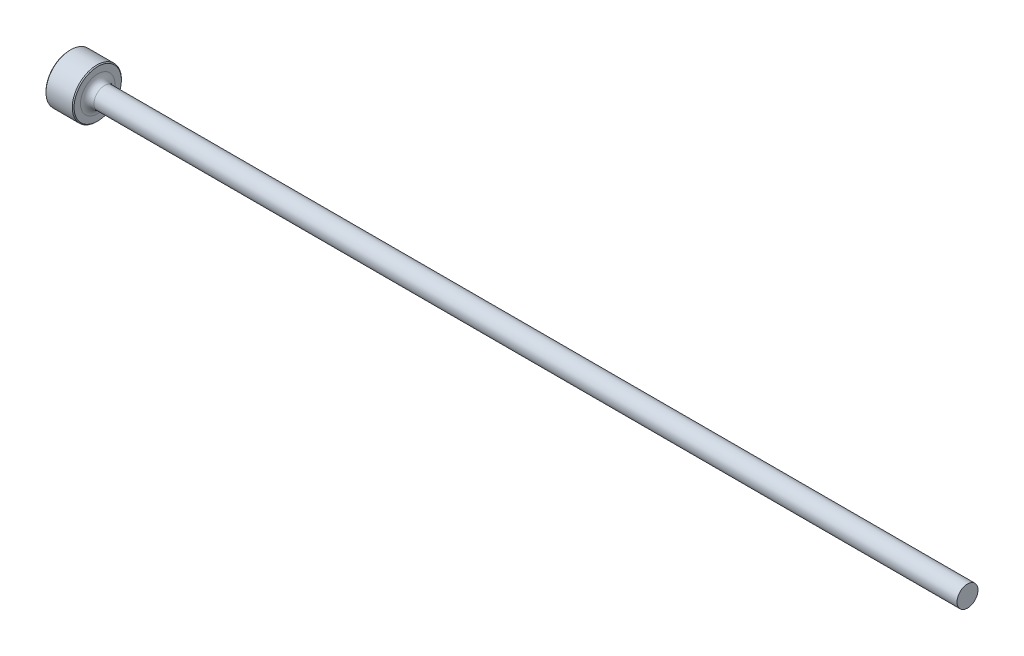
ISO-10303-21;
HEADER;
FILE_DESCRIPTION(('STEP AP214'),'2;1');
FILE_NAME('part.step','',(''),(''),'','','');
FILE_SCHEMA(('AUTOMOTIVE_DESIGN { 1 0 10303 214 1 1 1 1 }'));
ENDSEC;
DATA;
#1=APPLICATION_CONTEXT('core data for automotive mechanical design processes');
#2=APPLICATION_PROTOCOL_DEFINITION('international standard','automotive_design',2000,#1);
#3=PRODUCT_CONTEXT('',#1,'mechanical');
#4=PRODUCT('Part','Part','',(#3));
#5=PRODUCT_RELATED_PRODUCT_CATEGORY('part','',(#4));
#6=PRODUCT_DEFINITION_FORMATION('','',#4);
#7=PRODUCT_DEFINITION_CONTEXT('part definition',#1,'design');
#8=PRODUCT_DEFINITION('design','',#6,#7);
#9=PRODUCT_DEFINITION_SHAPE('','',#8);
#10=(LENGTH_UNIT() NAMED_UNIT(*) SI_UNIT(.MILLI.,.METRE.));
#11=(NAMED_UNIT(*) PLANE_ANGLE_UNIT() SI_UNIT($,.RADIAN.));
#12=(NAMED_UNIT(*) SI_UNIT($,.STERADIAN.) SOLID_ANGLE_UNIT());
#13=UNCERTAINTY_MEASURE_WITH_UNIT(LENGTH_MEASURE(1.E-05),#10,'distance_accuracy_value','');
#14=(GEOMETRIC_REPRESENTATION_CONTEXT(3) GLOBAL_UNCERTAINTY_ASSIGNED_CONTEXT((#13)) GLOBAL_UNIT_ASSIGNED_CONTEXT((#10,
#11,#12)) REPRESENTATION_CONTEXT('',''));
#15=CARTESIAN_POINT('',(0.,0.,0.));
#16=DIRECTION('',(0.,0.,1.));
#17=DIRECTION('',(1.,0.,0.));
#18=AXIS2_PLACEMENT_3D('',#15,#16,#17);
#19=CARTESIAN_POINT('',(101.6,1.18681499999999,0.));
#20=DIRECTION('',(1.,0.,0.));
#21=DIRECTION('',(0.,1.,0.));
#22=AXIS2_PLACEMENT_3D('',#19,#20,#21);
#23=PLANE('',#22);
#24=CARTESIAN_POINT('',(101.6,0.,0.));
#25=DIRECTION('',(1.,0.,0.));
#26=DIRECTION('',(0.,1.,0.));
#27=AXIS2_PLACEMENT_3D('',#24,#25,#26);
#28=CIRCLE('',#27,1.186815);
#29=CARTESIAN_POINT('',(101.6,1.18681499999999,0.));
#30=VERTEX_POINT('',#29);
#31=EDGE_CURVE('E50',#30,#30,#28,.T.);
#32=ORIENTED_EDGE('',*,*,#31,.T.);
#33=EDGE_LOOP('',(#32));
#34=FACE_BOUND('',#33,.T.);
#35=ADVANCED_FACE('F30',(#34),#23,.T.);
#36=CARTESIAN_POINT('',(101.6,0.,0.));
#37=DIRECTION('',(1.,0.,0.));
#38=DIRECTION('',(0.,1.,0.));
#39=AXIS2_PLACEMENT_3D('',#36,#37,#38);
#40=CYLINDRICAL_SURFACE('',#39,1.186815);
#41=CARTESIAN_POINT('',(3.937,0.,0.));
#42=DIRECTION('',(1.,0.,0.));
#43=DIRECTION('',(0.,1.,0.));
#44=AXIS2_PLACEMENT_3D('',#41,#42,#43);
#45=CIRCLE('',#44,1.18681499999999);
#46=CARTESIAN_POINT('',(3.937,1.18681499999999,0.));
#47=VERTEX_POINT('',#46);
#48=EDGE_CURVE('E53',#47,#47,#45,.T.);
#49=ORIENTED_EDGE('',*,*,#48,.T.);
#50=EDGE_LOOP('',(#49));
#51=FACE_BOUND('',#50,.T.);
#52=ORIENTED_EDGE('',*,*,#31,.F.);
#53=EDGE_LOOP('',(#52));
#54=FACE_BOUND('',#53,.T.);
#55=ADVANCED_FACE('F74',(#51,#54),#40,.T.);
#56=CARTESIAN_POINT('',(3.937,0.,0.));
#57=DIRECTION('',(1.,0.,0.));
#58=DIRECTION('',(0.,1.,0.));
#59=AXIS2_PLACEMENT_3D('',#56,#57,#58);
#60=TOROIDAL_SURFACE('',#59,1.94881499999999,0.762);
#61=CARTESIAN_POINT('',(3.175,0.,0.));
#62=DIRECTION('',(1.,0.,0.));
#63=DIRECTION('',(0.,1.,0.));
#64=AXIS2_PLACEMENT_3D('',#61,#62,#63);
#65=CIRCLE('',#64,1.94881499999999);
#66=CARTESIAN_POINT('',(3.175,1.94881499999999,0.));
#67=VERTEX_POINT('',#66);
#68=EDGE_CURVE('E56',#67,#67,#65,.T.);
#69=ORIENTED_EDGE('',*,*,#68,.T.);
#70=EDGE_LOOP('',(#69));
#71=FACE_BOUND('',#70,.T.);
#72=ORIENTED_EDGE('',*,*,#48,.F.);
#73=EDGE_LOOP('',(#72));
#74=FACE_BOUND('',#73,.T.);
#75=ADVANCED_FACE('F60',(#71,#74),#60,.F.);
#76=CARTESIAN_POINT('',(3.175,2.778125,0.));
#77=DIRECTION('',(1.,0.,0.));
#78=DIRECTION('',(0.,1.,0.));
#79=AXIS2_PLACEMENT_3D('',#76,#77,#78);
#80=PLANE('',#79);
#81=CARTESIAN_POINT('',(3.175,0.,0.));
#82=DIRECTION('',(1.,0.,0.));
#83=DIRECTION('',(0.,1.,0.));
#84=AXIS2_PLACEMENT_3D('',#81,#82,#83);
#85=CIRCLE('',#84,2.676525);
#86=CARTESIAN_POINT('',(3.175,2.676525,0.));
#87=VERTEX_POINT('',#86);
#88=EDGE_CURVE('E10',#87,#87,#85,.T.);
#89=ORIENTED_EDGE('',*,*,#88,.T.);
#90=EDGE_LOOP('',(#89));
#91=FACE_BOUND('',#90,.T.);
#92=ORIENTED_EDGE('',*,*,#68,.F.);
#93=EDGE_LOOP('',(#92));
#94=FACE_BOUND('',#93,.T.);
#95=ADVANCED_FACE('F63',(#91,#94),#80,.T.);
#96=CARTESIAN_POINT('',(101.6,0.,0.));
#97=DIRECTION('',(1.,0.,0.));
#98=DIRECTION('',(0.,1.,0.));
#99=AXIS2_PLACEMENT_3D('',#96,#97,#98);
#100=CYLINDRICAL_SURFACE('',#99,2.778125);
#101=CARTESIAN_POINT('',(0.101600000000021,0.,0.));
#102=DIRECTION('',(-1.,0.,0.));
#103=DIRECTION('',(0.,-1.,0.));
#104=AXIS2_PLACEMENT_3D('',#101,#102,#103);
#105=CIRCLE('',#104,2.778125);
#106=CARTESIAN_POINT('',(0.101600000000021,-2.778125,0.));
#107=VERTEX_POINT('',#106);
#108=EDGE_CURVE('E41',#107,#107,#105,.F.);
#109=ORIENTED_EDGE('',*,*,#108,.T.);
#110=EDGE_LOOP('',(#109));
#111=FACE_BOUND('',#110,.T.);
#112=CARTESIAN_POINT('',(3.0734,0.,0.));
#113=DIRECTION('',(1.,0.,0.));
#114=DIRECTION('',(0.,1.,0.));
#115=AXIS2_PLACEMENT_3D('',#112,#113,#114);
#116=CIRCLE('',#115,2.778125);
#117=CARTESIAN_POINT('',(3.0734,2.778125,0.));
#118=VERTEX_POINT('',#117);
#119=EDGE_CURVE('E45',#118,#118,#116,.F.);
#120=ORIENTED_EDGE('',*,*,#119,.T.);
#121=EDGE_LOOP('',(#120));
#122=FACE_BOUND('',#121,.T.);
#123=ADVANCED_FACE('F65',(#111,#122),#100,.T.);
#124=CARTESIAN_POINT('',(0.,0.,0.));
#125=DIRECTION('',(-1.,0.,0.));
#126=DIRECTION('',(0.,-1.,0.));
#127=AXIS2_PLACEMENT_3D('',#124,#125,#126);
#128=PLANE('',#127);
#129=CARTESIAN_POINT('',(0.,0.,0.));
#130=DIRECTION('',(-1.,0.,0.));
#131=DIRECTION('',(0.,-1.,0.));
#132=AXIS2_PLACEMENT_3D('',#129,#130,#131);
#133=CIRCLE('',#132,2.67652499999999);
#134=CARTESIAN_POINT('',(0.,-2.67652499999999,0.));
#135=VERTEX_POINT('',#134);
#136=EDGE_CURVE('E37',#135,#135,#133,.T.);
#137=ORIENTED_EDGE('',*,*,#136,.T.);
#138=EDGE_LOOP('',(#137));
#139=FACE_BOUND('',#138,.T.);
#140=ADVANCED_FACE('F71',(#139),#128,.T.);
#141=CARTESIAN_POINT('',(0.101600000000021,0.,0.));
#142=DIRECTION('',(1.,0.,0.));
#143=DIRECTION('',(0.,1.,0.));
#144=AXIS2_PLACEMENT_3D('',#141,#142,#143);
#145=CONICAL_SURFACE('',#144,2.778125,0.785398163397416);
#146=ORIENTED_EDGE('',*,*,#136,.F.);
#147=EDGE_LOOP('',(#146));
#148=FACE_BOUND('',#147,.T.);
#149=ORIENTED_EDGE('',*,*,#108,.F.);
#150=EDGE_LOOP('',(#149));
#151=FACE_BOUND('',#150,.T.);
#152=ADVANCED_FACE('F84',(#148,#151),#145,.T.);
#153=CARTESIAN_POINT('',(3.175,0.,0.));
#154=DIRECTION('',(-1.,0.,0.));
#155=DIRECTION('',(0.,-1.,0.));
#156=AXIS2_PLACEMENT_3D('',#153,#154,#155);
#157=CONICAL_SURFACE('',#156,2.676525,0.785398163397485);
#158=ORIENTED_EDGE('',*,*,#119,.F.);
#159=EDGE_LOOP('',(#158));
#160=FACE_BOUND('',#159,.T.);
#161=ORIENTED_EDGE('',*,*,#88,.F.);
#162=EDGE_LOOP('',(#161));
#163=FACE_BOUND('',#162,.T.);
#164=ADVANCED_FACE('F32',(#160,#163),#157,.T.);
#165=CLOSED_SHELL('',(#35,#55,#75,#95,#123,#140,#152,#164));
#166=MANIFOLD_SOLID_BREP('B2',#165);
#167=ADVANCED_BREP_SHAPE_REPRESENTATION('',(#18,#166),#14);
#168=SHAPE_DEFINITION_REPRESENTATION(#9,#167);
ENDSEC;
END-ISO-10303-21;
